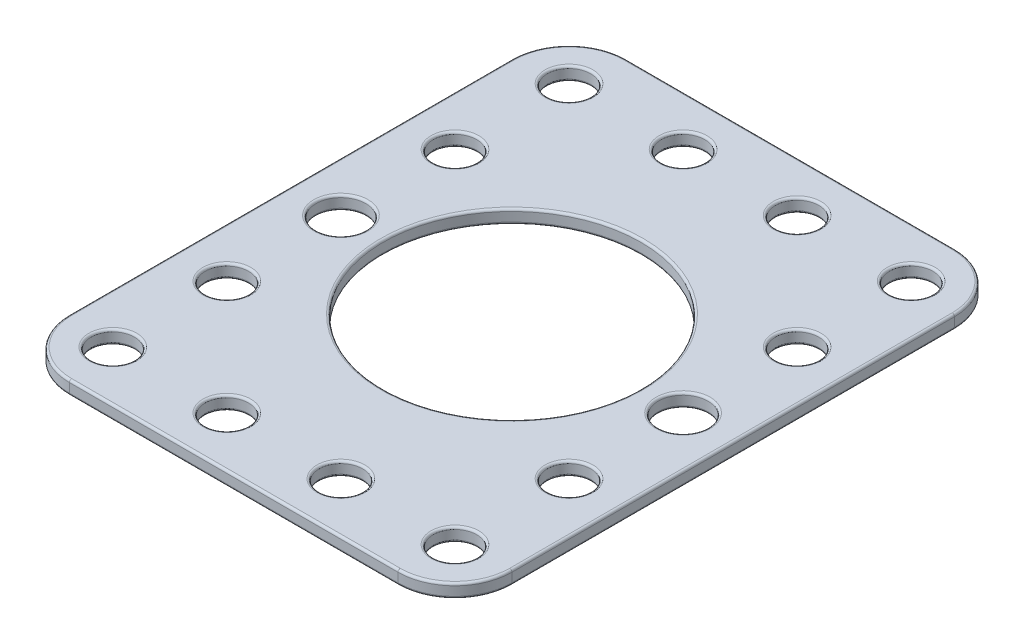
from build123d import *

# Parameters (mm, degrees)
SKETCH1_R          = 2.7686
SKETCH1_R_2        = 14.351
EXTRUDE1_DEPTH     = 1.524
SKETCH2_R          = 2.413
CUT_EXTRUDE1_DEPTH = 80.192621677
LPATTERN1_COUNT    = 4
LPATTERN1_PITCH    = 12.7
LPATTERN2_COUNT    = 5
LPATTERN2_PITCH    = 12.7
SKETCH3_R          = 2.413
CUT_EXTRUDE2_DEPTH = 80.192621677
LPATTERN3_COUNT    = 4
LPATTERN3_PITCH    = 12.7
LPATTERN4_COUNT    = 3
LPATTERN4_PITCH    = 12.7
FILLET1_R          = 0.254


with BuildPart() as part:
    # Sketch1 → Extrude1 (new body)
    with BuildSketch(Plane(origin=(0, 0, 0), x_dir=(1, 0, 0), z_dir=(0, 1, 0))):
        with BuildLine():
            Line((6.35, 0), (42.926, 0))
            ThreePointArc((42.926, 0), (47.416128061, 1.859871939), (49.276, 6.35))
            Line((49.276, 6.35), (49.276, 55.626))
            ThreePointArc((49.276, 55.626), (47.416128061, 60.116128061), (42.926, 61.976))
            Line((42.926, 61.976), (6.35, 61.976))
            ThreePointArc((6.35, 61.976), (1.859871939, 60.116128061), (0, 55.626))
            Line((0, 55.626), (0, 6.35))
            ThreePointArc((0, 6.35), (1.859871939, 1.859871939), (6.35, 0))
        make_face()
        with Locations(Location((5.588, 30.988, 0), (0, 0, 90))):
            Circle(SKETCH1_R, mode=Mode.SUBTRACT)
        with Locations(Location((43.688, 30.988, 0), (0, 0, 90))):
            Circle(SKETCH1_R, mode=Mode.SUBTRACT)
        with Locations(Location((24.638, 30.988, 0), (0, 0, 90))):
            Circle(SKETCH1_R_2, mode=Mode.SUBTRACT)
    extrude(amount=EXTRUDE1_DEPTH)

    # Sketch2 → Cut-Extrude1 (cut, through all)
    with BuildSketch(Plane(origin=(0, 1.524, 0), x_dir=(-1, 0, 0), z_dir=(0, 1, 0))):
        with Locations(Location((-5.588, -56.388, 0), (0, 0, 90))):
            Circle(SKETCH2_R)
    cut_extrude1 = extrude(amount=-CUT_EXTRUDE1_DEPTH, mode=Mode.SUBTRACT)

    # LPattern1: Cut-Extrude1 ×4
    with Locations(*[(i * LPATTERN1_PITCH, 0, 0) for i in range(1, LPATTERN1_COUNT)]):
        add(cut_extrude1, mode=Mode.SUBTRACT)

    # LPattern2: Cut-Extrude1 ×5, 1 skipped
    with Locations(*[(0, 0, i * LPATTERN2_PITCH) for i in range(1, LPATTERN2_COUNT) if i not in (2,)]):
        add(cut_extrude1, mode=Mode.SUBTRACT)

    # Sketch3 → Cut-Extrude2 (cut, through all)
    with BuildSketch(Plane(origin=(0, 1.524, 0), x_dir=(-1, 0, 0), z_dir=(0, 1, 0))):
        with Locations(Location((-43.688, -5.588, 0), (0, 0, 90))):
            Circle(SKETCH3_R)
    cut_extrude2 = extrude(amount=-CUT_EXTRUDE2_DEPTH, mode=Mode.SUBTRACT)

    # LPattern3: Cut-Extrude2 ×4, 1 skipped
    with Locations(*[(0, 0, -i * LPATTERN3_PITCH) for i in range(1, LPATTERN3_COUNT) if i not in (2,)]):
        add(cut_extrude2, mode=Mode.SUBTRACT)

    # LPattern4: Cut-Extrude2 ×3
    with Locations(*[(-i * LPATTERN4_PITCH, 0, 0) for i in range(1, LPATTERN4_COUNT)]):
        add(cut_extrude2, mode=Mode.SUBTRACT)

    # Fillet1
    fillet1_edges = [part.edges().sort_by_distance(p)[0] for p in [
        (1.859871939, 1.524, -1.859871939),
        (24.638, 1.524, 0),
        (47.416128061, 1.524, -1.859871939),
        (49.276, 1.524, -30.988),
        (5.588, 0, -28.2194),
        (5.588, 1.524, -28.2194),
        (47.416128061, 1.524, -60.116128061),
        (43.688, 0, -28.2194),
        (43.688, 1.524, -28.2194),
        (24.638, 1.524, -61.976),
        (24.638, 0, -16.637),
        (24.638, 1.524, -16.637),
        (5.588, 0, -58.801),
        (5.588, 1.524, -58.801),
        (1.859871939, 1.524, -60.116128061),
        (18.288, 0, -58.801),
        (18.288, 1.524, -58.801),
        (30.988, 0, -58.801),
        (30.988, 1.524, -58.801),
        (43.688, 0, -58.801),
        (43.688, 1.524, -58.801),
        (5.588, 0, -46.101),
        (5.588, 1.524, -46.101),
        (5.588, 0, -20.701),
        (5.588, 1.524, -20.701),
        (5.588, 0, -8.001),
        (5.588, 1.524, -8.001),
        (43.688, 0, -8.001),
        (43.688, 1.524, -8.001),
        (24.638, 0, -61.976),
        (0, 1.524, -30.988),
        (43.688, 0, -20.701),
        (43.688, 1.524, -20.701),
        (47.416128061, 0, -60.116128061),
        (43.688, 0, -46.101),
        (43.688, 1.524, -46.101),
        (49.276, 0, -30.988),
        (30.988, 1.524, -8.001),
        (30.988, 0, -8.001),
        (47.416128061, 0, -1.859871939),
        (18.288, 0, -8.001),
        (18.288, 1.524, -8.001),
        (24.638, 0, 0),
        (1.859871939, 0, -1.859871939),
        (0, 0, -30.988),
        (1.859871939, 0, -60.116128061),
    ]]
    fillet(fillet1_edges, radius=FILLET1_R)


solid = part.part
